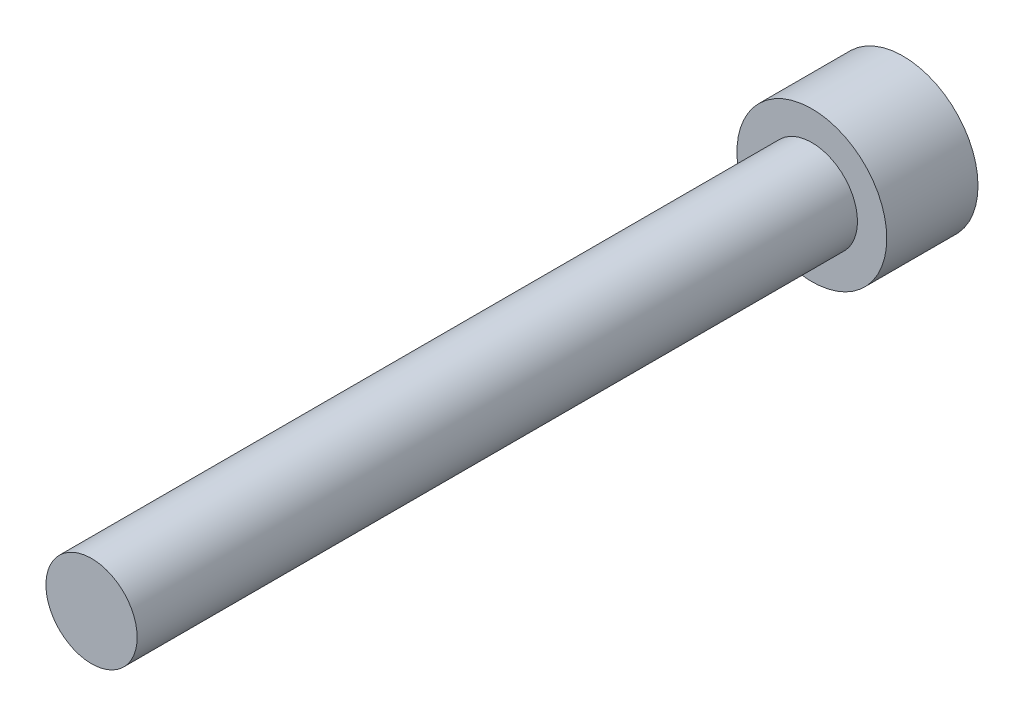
from build123d import *

# Parameters (mm, degrees)
HEX_2_DEPTH = 3.048


with BuildPart() as part:
    # Sketch6 → Revolve1 (revolve)
    with BuildSketch(Plane(origin=(0, 0, 0), x_dir=(0, 0, -1), z_dir=(1, 0, 0)), mode=Mode.PRIVATE) as revolve1_sk:
        Polygon((-38.1, 0), (-38.1, -2.413), (0, -2.413), (0, -3.9624), (4.826, -3.9624), (4.826, 0), align=None)
    revolve(revolve1_sk.sketch.rotate(Axis((0, 0, 38.1), (0, 0, -1)), 270), axis=Axis((0, 0, 38.1), (0, 0, -1)))

    # Sketch7 → HEX 2 (cut)
    with BuildSketch(Plane(origin=(0, 0, -4.826), x_dir=(-1, 0, 0), z_dir=(0, 0, -1))):
        Polygon((-1.9812, 1.143846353), (-1.9812, -1.143846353), (0, -2.287692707), (1.9812, -1.143846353), (1.9812, 1.143846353), (0, 2.287692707), align=None)
    extrude(amount=-HEX_2_DEPTH, mode=Mode.SUBTRACT)


solid = part.part
